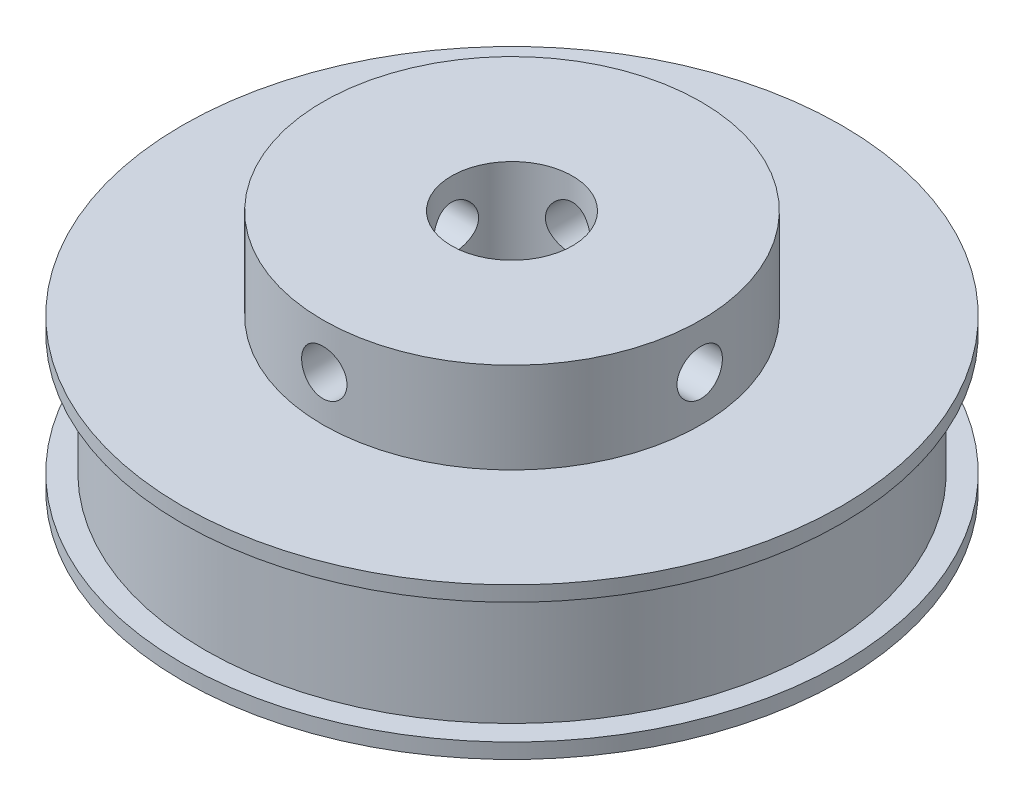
from build123d import *

# Parameters (mm, degrees)
SKETCH_2_R               = 21.8
EXTRUDE_1_DEPTH          = 16
SKETCH_3_R               = 4
CUT_EXTRUDE_1_DEPTH      = 35.734420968
SKETCH_4_OUTSIDE_W       = 58.34
SKETCH_4_OUTSIDE_H       = 58.34
SKETCH_4_OUTSIDE_R       = 12.5
CUT_EXTRUDE_2_DEPTH      = 6
SKETCH_5_OUTSIDE_W       = 58.34
SKETCH_5_OUTSIDE_H       = 58.34
SKETCH_5_OUTSIDE_R       = 20.3
CUT_EXTRUDE_3_DEPTH      = 8
CUT_EXTRUDE_4_DEPTH      = 35.734420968
CUT_EXTRUDE_4_DEPTH_BACK = 35.734420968
SKETCH_6_R               = 1.5
CUT_EXTRUDE_5_DEPTH      = 35.734421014
CUT_EXTRUDE_5_DEPTH_BACK = 35.734421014
SKETCH_7_R               = 1.5


with BuildPart() as part:
    # Sketch 2 → Extrude 1 (new body)
    with BuildSketch(Plane(origin=(0, 0, 0), x_dir=(1, 0, 0), z_dir=(0, 1, 0))):
        with Locations(Location((0, 0, 0), (0, 0, 270))):
            Circle(SKETCH_2_R)
    extrude(amount=EXTRUDE_1_DEPTH)

    # Sketch 3 → Cut-Extrude 1 (cut, through all)
    with BuildSketch(Plane(origin=(0, 16, 0), x_dir=(1, 0, 0), z_dir=(0, 1, 0))):
        with Locations(Location((0, 0, 0), (0, 0, 270))):
            Circle(SKETCH_3_R)
    extrude(amount=-CUT_EXTRUDE_1_DEPTH, mode=Mode.SUBTRACT)

    # Sketch 4 outside → Cut-Extrude 2 (cut)
    with BuildSketch(Plane(origin=(0, 16, 0), x_dir=(1, 0, 0), z_dir=(0, 1, 0))):
        Rectangle(SKETCH_4_OUTSIDE_W, SKETCH_4_OUTSIDE_H)
        with Locations(Location((0, 0, 0), (0, 0, 270))):
            Circle(SKETCH_4_OUTSIDE_R, mode=Mode.SUBTRACT)
    extrude(amount=-CUT_EXTRUDE_2_DEPTH, mode=Mode.SUBTRACT)

    # Sketch 5 outside → Cut-Extrude 3 (cut)
    with BuildSketch(Plane(origin=(0, 1, 0), x_dir=(1, 0, 0), z_dir=(0, 1, 0))):
        Rectangle(SKETCH_5_OUTSIDE_W, SKETCH_5_OUTSIDE_H)
        with Locations(Location((0, 0, 0), (0, 0, 270))):
            Circle(SKETCH_5_OUTSIDE_R, mode=Mode.SUBTRACT)
    extrude(amount=CUT_EXTRUDE_3_DEPTH, mode=Mode.SUBTRACT)

    # Sketch 6 → Cut-Extrude 4 (cut, two sides: drawn at the far end of the back side and taken through both)
    with BuildSketch(Plane(origin=(0, 0, 0), x_dir=(0, 0, -1), z_dir=(1, 0, 0)).offset(-CUT_EXTRUDE_4_DEPTH_BACK)):
        with Locations((0, 13)):
            Circle(SKETCH_6_R)
    extrude(amount=CUT_EXTRUDE_4_DEPTH + CUT_EXTRUDE_4_DEPTH_BACK, mode=Mode.SUBTRACT)

    # Sketch 7 → Cut-Extrude 5 (cut, two sides: drawn at the far end of the back side and taken through both)
    with BuildSketch(Plane.XY.offset(-CUT_EXTRUDE_5_DEPTH_BACK)):
        with Locations((0, 13)):
            Circle(SKETCH_7_R)
    extrude(amount=CUT_EXTRUDE_5_DEPTH + CUT_EXTRUDE_5_DEPTH_BACK, mode=Mode.SUBTRACT)


solid = part.part
